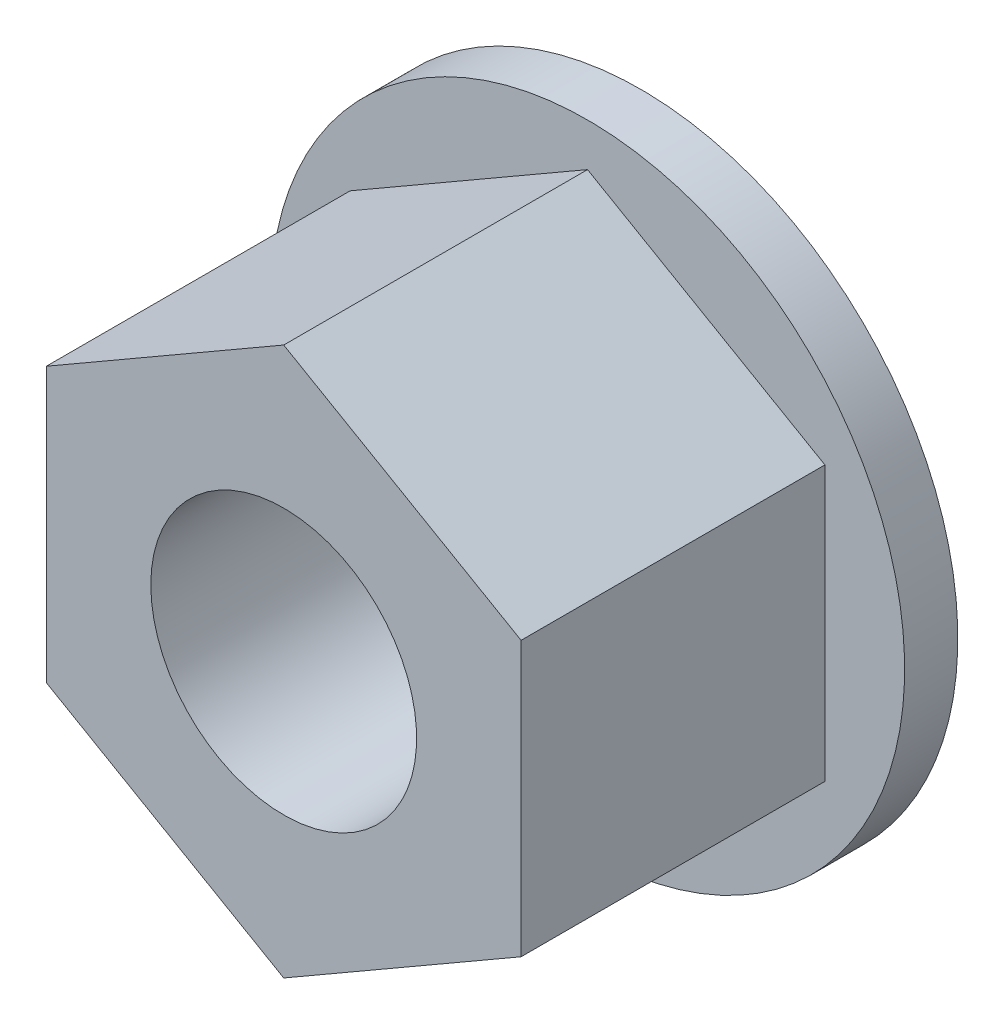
ISO-10303-21;
HEADER;
FILE_DESCRIPTION(('STEP AP214'),'2;1');
FILE_NAME('part.step','',(''),(''),'','','');
FILE_SCHEMA(('AUTOMOTIVE_DESIGN { 1 0 10303 214 1 1 1 1 }'));
ENDSEC;
DATA;
#1=APPLICATION_CONTEXT('core data for automotive mechanical design processes');
#2=APPLICATION_PROTOCOL_DEFINITION('international standard','automotive_design',2000,#1);
#3=PRODUCT_CONTEXT('',#1,'mechanical');
#4=PRODUCT('Part','Part','',(#3));
#5=PRODUCT_RELATED_PRODUCT_CATEGORY('part','',(#4));
#6=PRODUCT_DEFINITION_FORMATION('','',#4);
#7=PRODUCT_DEFINITION_CONTEXT('part definition',#1,'design');
#8=PRODUCT_DEFINITION('design','',#6,#7);
#9=PRODUCT_DEFINITION_SHAPE('','',#8);
#10=(LENGTH_UNIT() NAMED_UNIT(*) SI_UNIT(.MILLI.,.METRE.));
#11=(NAMED_UNIT(*) PLANE_ANGLE_UNIT() SI_UNIT($,.RADIAN.));
#12=(NAMED_UNIT(*) SI_UNIT($,.STERADIAN.) SOLID_ANGLE_UNIT());
#13=UNCERTAINTY_MEASURE_WITH_UNIT(LENGTH_MEASURE(1.E-05),#10,'distance_accuracy_value','');
#14=(GEOMETRIC_REPRESENTATION_CONTEXT(3) GLOBAL_UNCERTAINTY_ASSIGNED_CONTEXT((#13)) GLOBAL_UNIT_ASSIGNED_CONTEXT((#10,
#11,#12)) REPRESENTATION_CONTEXT('',''));
#15=CARTESIAN_POINT('',(0.,0.,0.));
#16=DIRECTION('',(0.,0.,1.));
#17=DIRECTION('',(1.,0.,0.));
#18=AXIS2_PLACEMENT_3D('',#15,#16,#17);
#19=CARTESIAN_POINT('',(1.5875,-0.91654355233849,2.3876));
#20=DIRECTION('',(-0.500000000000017,0.866025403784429,0.));
#21=DIRECTION('',(-0.866025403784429,-0.500000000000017,0.));
#22=AXIS2_PLACEMENT_3D('',#19,#20,#21);
#23=PLANE('',#22);
#24=DIRECTION('',(-0.866025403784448,-0.499999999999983,0.));
#25=VECTOR('',#24,1.);
#26=CARTESIAN_POINT('',(1.5875,-0.91654355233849,0.3556));
#27=LINE('',#26,#25);
#28=CARTESIAN_POINT('',(1.5875,-0.91654355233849,0.3556));
#29=VERTEX_POINT('',#28);
#30=CARTESIAN_POINT('',(0.,-1.833087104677,0.3556));
#31=VERTEX_POINT('',#30);
#32=EDGE_CURVE('E95',#29,#31,#27,.T.);
#33=ORIENTED_EDGE('',*,*,#32,.F.);
#34=DIRECTION('',(0.,0.,1.));
#35=VECTOR('',#34,1.);
#36=CARTESIAN_POINT('',(1.5875,-0.91654355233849,2.3876));
#37=LINE('',#36,#35);
#38=CARTESIAN_POINT('',(1.5875,-0.91654355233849,2.3876));
#39=VERTEX_POINT('',#38);
#40=EDGE_CURVE('E96',#29,#39,#37,.T.);
#41=ORIENTED_EDGE('',*,*,#40,.T.);
#42=DIRECTION('',(-0.866025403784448,-0.499999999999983,0.));
#43=VECTOR('',#42,1.);
#44=CARTESIAN_POINT('',(1.5875,-0.91654355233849,2.3876));
#45=LINE('',#44,#43);
#46=CARTESIAN_POINT('',(0.,-1.83308710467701,2.3876));
#47=VERTEX_POINT('',#46);
#48=EDGE_CURVE('E128',#39,#47,#45,.T.);
#49=ORIENTED_EDGE('',*,*,#48,.T.);
#50=DIRECTION('',(0.,0.,1.));
#51=VECTOR('',#50,1.);
#52=CARTESIAN_POINT('',(0.,-1.83308710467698,2.3876));
#53=LINE('',#52,#51);
#54=EDGE_CURVE('E66',#47,#31,#53,.F.);
#55=ORIENTED_EDGE('',*,*,#54,.T.);
#56=EDGE_LOOP('',(#33,#41,#49,#55));
#57=FACE_BOUND('',#56,.T.);
#58=ADVANCED_FACE('F16',(#57),#23,.F.);
#59=CARTESIAN_POINT('',(0.,-1.83308710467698,2.3876));
#60=DIRECTION('',(0.500000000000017,0.866025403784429,0.));
#61=DIRECTION('',(-0.866025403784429,0.500000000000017,0.));
#62=AXIS2_PLACEMENT_3D('',#59,#60,#61);
#63=PLANE('',#62);
#64=DIRECTION('',(-0.866025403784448,0.499999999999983,0.));
#65=VECTOR('',#64,1.);
#66=CARTESIAN_POINT('',(0.,-1.83308710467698,0.3556));
#67=LINE('',#66,#65);
#68=CARTESIAN_POINT('',(-1.58749999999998,-0.916543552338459,0.3556));
#69=VERTEX_POINT('',#68);
#70=EDGE_CURVE('E75',#31,#69,#67,.T.);
#71=ORIENTED_EDGE('',*,*,#70,.F.);
#72=ORIENTED_EDGE('',*,*,#54,.F.);
#73=DIRECTION('',(-0.866025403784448,0.499999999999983,0.));
#74=VECTOR('',#73,1.);
#75=CARTESIAN_POINT('',(0.,-1.83308710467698,2.3876));
#76=LINE('',#75,#74);
#77=CARTESIAN_POINT('',(-1.58749999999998,-0.916543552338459,2.3876));
#78=VERTEX_POINT('',#77);
#79=EDGE_CURVE('E78',#47,#78,#76,.T.);
#80=ORIENTED_EDGE('',*,*,#79,.T.);
#81=DIRECTION('',(0.,0.,-1.));
#82=VECTOR('',#81,1.);
#83=CARTESIAN_POINT('',(-1.5875,-0.91654355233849,2.3876));
#84=LINE('',#83,#82);
#85=EDGE_CURVE('E71',#78,#69,#84,.T.);
#86=ORIENTED_EDGE('',*,*,#85,.T.);
#87=EDGE_LOOP('',(#71,#72,#80,#86));
#88=FACE_BOUND('',#87,.T.);
#89=ADVANCED_FACE('F73',(#88),#63,.F.);
#90=CARTESIAN_POINT('',(-1.5875,-0.91654355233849,2.3876));
#91=DIRECTION('',(1.,0.,0.));
#92=DIRECTION('',(0.,0.,-1.));
#93=AXIS2_PLACEMENT_3D('',#90,#91,#92);
#94=PLANE('',#93);
#95=DIRECTION('',(0.,1.,0.));
#96=VECTOR('',#95,1.);
#97=CARTESIAN_POINT('',(-1.5875,0.,0.3556));
#98=LINE('',#97,#96);
#99=CARTESIAN_POINT('',(-1.5875,0.91654355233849,0.3556));
#100=VERTEX_POINT('',#99);
#101=EDGE_CURVE('E84',#69,#100,#98,.T.);
#102=ORIENTED_EDGE('',*,*,#101,.F.);
#103=ORIENTED_EDGE('',*,*,#85,.F.);
#104=DIRECTION('',(0.,1.,0.));
#105=VECTOR('',#104,1.);
#106=CARTESIAN_POINT('',(-1.5875,0.,2.3876));
#107=LINE('',#106,#105);
#108=CARTESIAN_POINT('',(-1.5875,0.91654355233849,2.3876));
#109=VERTEX_POINT('',#108);
#110=EDGE_CURVE('E125',#78,#109,#107,.T.);
#111=ORIENTED_EDGE('',*,*,#110,.T.);
#112=DIRECTION('',(0.,0.,1.));
#113=VECTOR('',#112,1.);
#114=CARTESIAN_POINT('',(-1.5875,0.91654355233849,2.3876));
#115=LINE('',#114,#113);
#116=EDGE_CURVE('E81',#109,#100,#115,.F.);
#117=ORIENTED_EDGE('',*,*,#116,.T.);
#118=EDGE_LOOP('',(#102,#103,#111,#117));
#119=FACE_BOUND('',#118,.T.);
#120=ADVANCED_FACE('F85',(#119),#94,.F.);
#121=CARTESIAN_POINT('',(-1.5875,0.91654355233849,2.3876));
#122=DIRECTION('',(0.500000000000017,-0.866025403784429,0.));
#123=DIRECTION('',(0.866025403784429,0.500000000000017,0.));
#124=AXIS2_PLACEMENT_3D('',#121,#122,#123);
#125=PLANE('',#124);
#126=DIRECTION('',(0.866025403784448,0.499999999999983,0.));
#127=VECTOR('',#126,1.);
#128=CARTESIAN_POINT('',(-1.5875,0.91654355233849,0.3556));
#129=LINE('',#128,#127);
#130=CARTESIAN_POINT('',(0.,1.83308710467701,0.3556));
#131=VERTEX_POINT('',#130);
#132=EDGE_CURVE('E90',#100,#131,#129,.T.);
#133=ORIENTED_EDGE('',*,*,#132,.F.);
#134=ORIENTED_EDGE('',*,*,#116,.F.);
#135=DIRECTION('',(0.866025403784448,0.499999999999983,0.));
#136=VECTOR('',#135,1.);
#137=CARTESIAN_POINT('',(-1.5875,0.91654355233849,2.3876));
#138=LINE('',#137,#136);
#139=CARTESIAN_POINT('',(0.,1.83308710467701,2.3876));
#140=VERTEX_POINT('',#139);
#141=EDGE_CURVE('E121',#109,#140,#138,.T.);
#142=ORIENTED_EDGE('',*,*,#141,.T.);
#143=DIRECTION('',(0.,0.,1.));
#144=VECTOR('',#143,1.);
#145=CARTESIAN_POINT('',(0.,1.83308710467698,2.3876));
#146=LINE('',#145,#144);
#147=EDGE_CURVE('E103',#140,#131,#146,.F.);
#148=ORIENTED_EDGE('',*,*,#147,.T.);
#149=EDGE_LOOP('',(#133,#134,#142,#148));
#150=FACE_BOUND('',#149,.T.);
#151=ADVANCED_FACE('F137',(#150),#125,.F.);
#152=CARTESIAN_POINT('',(0.,1.83308710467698,2.3876));
#153=DIRECTION('',(-0.500000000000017,-0.866025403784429,0.));
#154=DIRECTION('',(0.866025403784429,-0.500000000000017,0.));
#155=AXIS2_PLACEMENT_3D('',#152,#153,#154);
#156=PLANE('',#155);
#157=DIRECTION('',(0.866025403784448,-0.499999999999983,0.));
#158=VECTOR('',#157,1.);
#159=CARTESIAN_POINT('',(0.,1.83308710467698,0.3556));
#160=LINE('',#159,#158);
#161=CARTESIAN_POINT('',(1.58749999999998,0.916543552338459,0.3556));
#162=VERTEX_POINT('',#161);
#163=EDGE_CURVE('E133',#131,#162,#160,.T.);
#164=ORIENTED_EDGE('',*,*,#163,.F.);
#165=ORIENTED_EDGE('',*,*,#147,.F.);
#166=DIRECTION('',(0.866025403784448,-0.499999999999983,0.));
#167=VECTOR('',#166,1.);
#168=CARTESIAN_POINT('',(0.,1.83308710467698,2.3876));
#169=LINE('',#168,#167);
#170=CARTESIAN_POINT('',(1.58749999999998,0.916543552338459,2.3876));
#171=VERTEX_POINT('',#170);
#172=EDGE_CURVE('E34',#140,#171,#169,.T.);
#173=ORIENTED_EDGE('',*,*,#172,.T.);
#174=DIRECTION('',(0.,0.,1.));
#175=VECTOR('',#174,1.);
#176=CARTESIAN_POINT('',(1.5875,0.91654355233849,2.3876));
#177=LINE('',#176,#175);
#178=EDGE_CURVE('E98',#171,#162,#177,.F.);
#179=ORIENTED_EDGE('',*,*,#178,.T.);
#180=EDGE_LOOP('',(#164,#165,#173,#179));
#181=FACE_BOUND('',#180,.T.);
#182=ADVANCED_FACE('F139',(#181),#156,.F.);
#183=CARTESIAN_POINT('',(1.5875,0.91654355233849,2.3876));
#184=DIRECTION('',(-1.,0.,0.));
#185=DIRECTION('',(0.,0.,1.));
#186=AXIS2_PLACEMENT_3D('',#183,#184,#185);
#187=PLANE('',#186);
#188=DIRECTION('',(0.,1.,0.));
#189=VECTOR('',#188,1.);
#190=CARTESIAN_POINT('',(1.5875,0.,0.3556));
#191=LINE('',#190,#189);
#192=EDGE_CURVE('E131',#162,#29,#191,.F.);
#193=ORIENTED_EDGE('',*,*,#192,.F.);
#194=ORIENTED_EDGE('',*,*,#178,.F.);
#195=DIRECTION('',(0.,1.,0.));
#196=VECTOR('',#195,1.);
#197=CARTESIAN_POINT('',(1.5875,0.,2.3876));
#198=LINE('',#197,#196);
#199=EDGE_CURVE('E113',#171,#39,#198,.F.);
#200=ORIENTED_EDGE('',*,*,#199,.T.);
#201=ORIENTED_EDGE('',*,*,#40,.F.);
#202=EDGE_LOOP('',(#193,#194,#200,#201));
#203=FACE_BOUND('',#202,.T.);
#204=ADVANCED_FACE('F141',(#203),#187,.F.);
#205=CARTESIAN_POINT('',(0.,0.,0.3556));
#206=DIRECTION('',(0.,0.,1.));
#207=DIRECTION('',(1.,0.,0.));
#208=AXIS2_PLACEMENT_3D('',#205,#206,#207);
#209=PLANE('',#208);
#210=ORIENTED_EDGE('',*,*,#192,.T.);
#211=ORIENTED_EDGE('',*,*,#32,.T.);
#212=ORIENTED_EDGE('',*,*,#70,.T.);
#213=ORIENTED_EDGE('',*,*,#101,.T.);
#214=ORIENTED_EDGE('',*,*,#132,.T.);
#215=ORIENTED_EDGE('',*,*,#163,.T.);
#216=EDGE_LOOP('',(#210,#211,#212,#213,#214,#215));
#217=FACE_BOUND('',#216,.T.);
#218=CARTESIAN_POINT('',(0.,0.,0.3556));
#219=DIRECTION('',(0.,0.,-1.));
#220=DIRECTION('',(-1.,0.,0.));
#221=AXIS2_PLACEMENT_3D('',#218,#219,#220);
#222=CIRCLE('',#221,2.1209);
#223=CARTESIAN_POINT('',(-2.1209,0.,0.3556));
#224=VERTEX_POINT('',#223);
#225=EDGE_CURVE('E19',#224,#224,#222,.T.);
#226=ORIENTED_EDGE('',*,*,#225,.F.);
#227=EDGE_LOOP('',(#226));
#228=FACE_BOUND('',#227,.T.);
#229=ADVANCED_FACE('F93',(#217,#228),#209,.T.);
#230=CARTESIAN_POINT('',(0.,0.,2.3876));
#231=DIRECTION('',(0.,0.,-1.));
#232=DIRECTION('',(-1.,0.,0.));
#233=AXIS2_PLACEMENT_3D('',#230,#231,#232);
#234=PLANE('',#233);
#235=CARTESIAN_POINT('',(0.,0.,2.3876));
#236=DIRECTION('',(0.,0.,-1.));
#237=DIRECTION('',(-1.,0.,0.));
#238=AXIS2_PLACEMENT_3D('',#235,#236,#237);
#239=CIRCLE('',#238,0.889);
#240=CARTESIAN_POINT('',(-0.889,0.,2.3876));
#241=VERTEX_POINT('',#240);
#242=EDGE_CURVE('E108',#241,#241,#239,.T.);
#243=ORIENTED_EDGE('',*,*,#242,.T.);
#244=EDGE_LOOP('',(#243));
#245=FACE_BOUND('',#244,.T.);
#246=ORIENTED_EDGE('',*,*,#172,.F.);
#247=ORIENTED_EDGE('',*,*,#141,.F.);
#248=ORIENTED_EDGE('',*,*,#110,.F.);
#249=ORIENTED_EDGE('',*,*,#79,.F.);
#250=ORIENTED_EDGE('',*,*,#48,.F.);
#251=ORIENTED_EDGE('',*,*,#199,.F.);
#252=EDGE_LOOP('',(#246,#247,#248,#249,#250,#251));
#253=FACE_BOUND('',#252,.T.);
#254=ADVANCED_FACE('F162',(#245,#253),#234,.F.);
#255=CARTESIAN_POINT('',(0.,0.,2.50698));
#256=DIRECTION('',(0.,0.,-1.));
#257=DIRECTION('',(-1.,0.,0.));
#258=AXIS2_PLACEMENT_3D('',#255,#256,#257);
#259=CYLINDRICAL_SURFACE('',#258,2.1209);
#260=CARTESIAN_POINT('',(0.,0.,0.));
#261=DIRECTION('',(0.,0.,-1.));
#262=DIRECTION('',(-1.,0.,0.));
#263=AXIS2_PLACEMENT_3D('',#260,#261,#262);
#264=CIRCLE('',#263,2.1209);
#265=CARTESIAN_POINT('',(-2.1209,0.,0.));
#266=VERTEX_POINT('',#265);
#267=EDGE_CURVE('E25',#266,#266,#264,.T.);
#268=ORIENTED_EDGE('',*,*,#267,.F.);
#269=EDGE_LOOP('',(#268));
#270=FACE_BOUND('',#269,.T.);
#271=ORIENTED_EDGE('',*,*,#225,.T.);
#272=EDGE_LOOP('',(#271));
#273=FACE_BOUND('',#272,.T.);
#274=ADVANCED_FACE('F155',(#270,#273),#259,.T.);
#275=CARTESIAN_POINT('',(0.,0.,2.3876));
#276=DIRECTION('',(0.,0.,-1.));
#277=DIRECTION('',(-1.,0.,0.));
#278=AXIS2_PLACEMENT_3D('',#275,#276,#277);
#279=CYLINDRICAL_SURFACE('',#278,0.889);
#280=ORIENTED_EDGE('',*,*,#242,.F.);
#281=EDGE_LOOP('',(#280));
#282=FACE_BOUND('',#281,.T.);
#283=CARTESIAN_POINT('',(0.,0.,0.));
#284=DIRECTION('',(0.,0.,-1.));
#285=DIRECTION('',(-1.,0.,0.));
#286=AXIS2_PLACEMENT_3D('',#283,#284,#285);
#287=CIRCLE('',#286,0.889);
#288=CARTESIAN_POINT('',(-0.889,0.,0.));
#289=VERTEX_POINT('',#288);
#290=EDGE_CURVE('E11',#289,#289,#287,.F.);
#291=ORIENTED_EDGE('',*,*,#290,.F.);
#292=EDGE_LOOP('',(#291));
#293=FACE_BOUND('',#292,.T.);
#294=ADVANCED_FACE('F149',(#282,#293),#279,.F.);
#295=CARTESIAN_POINT('',(0.,0.,0.));
#296=DIRECTION('',(0.,0.,-1.));
#297=DIRECTION('',(-1.,0.,0.));
#298=AXIS2_PLACEMENT_3D('',#295,#296,#297);
#299=PLANE('',#298);
#300=ORIENTED_EDGE('',*,*,#290,.T.);
#301=EDGE_LOOP('',(#300));
#302=FACE_BOUND('',#301,.T.);
#303=ORIENTED_EDGE('',*,*,#267,.T.);
#304=EDGE_LOOP('',(#303));
#305=FACE_BOUND('',#304,.T.);
#306=ADVANCED_FACE('F147',(#302,#305),#299,.T.);
#307=CLOSED_SHELL('',(#58,#89,#120,#151,#182,#204,#229,#254,#274,#294,#306));
#308=MANIFOLD_SOLID_BREP('B1',#307);
#309=ADVANCED_BREP_SHAPE_REPRESENTATION('',(#18,#308),#14);
#310=SHAPE_DEFINITION_REPRESENTATION(#9,#309);
ENDSEC;
END-ISO-10303-21;
